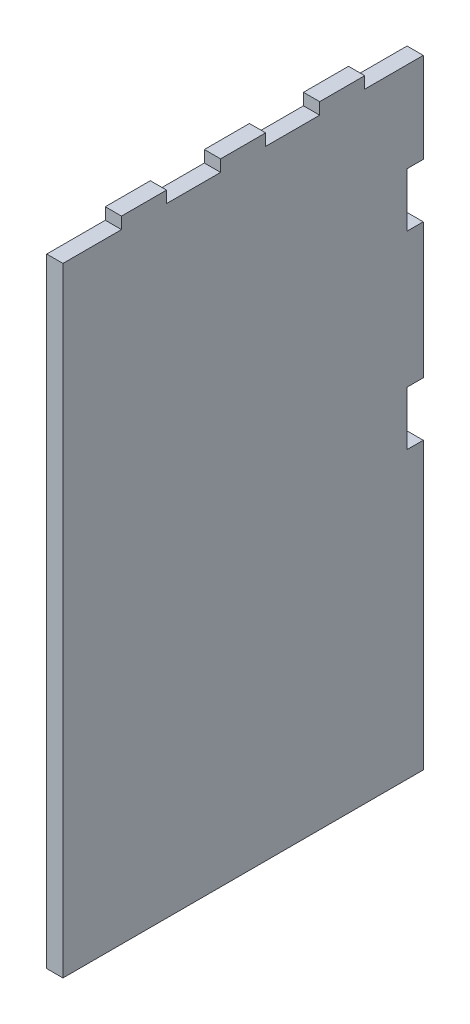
ISO-10303-21;
HEADER;
FILE_DESCRIPTION(('STEP AP214'),'2;1');
FILE_NAME('part.step','',(''),(''),'','','');
FILE_SCHEMA(('AUTOMOTIVE_DESIGN { 1 0 10303 214 1 1 1 1 }'));
ENDSEC;
DATA;
#1=APPLICATION_CONTEXT('core data for automotive mechanical design processes');
#2=APPLICATION_PROTOCOL_DEFINITION('international standard','automotive_design',2000,#1);
#3=PRODUCT_CONTEXT('',#1,'mechanical');
#4=PRODUCT('Part','Part','',(#3));
#5=PRODUCT_RELATED_PRODUCT_CATEGORY('part','',(#4));
#6=PRODUCT_DEFINITION_FORMATION('','',#4);
#7=PRODUCT_DEFINITION_CONTEXT('part definition',#1,'design');
#8=PRODUCT_DEFINITION('design','',#6,#7);
#9=PRODUCT_DEFINITION_SHAPE('','',#8);
#10=(LENGTH_UNIT() NAMED_UNIT(*) SI_UNIT(.MILLI.,.METRE.));
#11=(NAMED_UNIT(*) PLANE_ANGLE_UNIT() SI_UNIT($,.RADIAN.));
#12=(NAMED_UNIT(*) SI_UNIT($,.STERADIAN.) SOLID_ANGLE_UNIT());
#13=UNCERTAINTY_MEASURE_WITH_UNIT(LENGTH_MEASURE(1.E-05),#10,'distance_accuracy_value','');
#14=(GEOMETRIC_REPRESENTATION_CONTEXT(3) GLOBAL_UNCERTAINTY_ASSIGNED_CONTEXT((#13)) GLOBAL_UNIT_ASSIGNED_CONTEXT((#10,
#11,#12)) REPRESENTATION_CONTEXT('',''));
#15=CARTESIAN_POINT('',(0.,0.,0.));
#16=DIRECTION('',(0.,0.,1.));
#17=DIRECTION('',(1.,0.,0.));
#18=AXIS2_PLACEMENT_3D('',#15,#16,#17);
#19=CARTESIAN_POINT('',(18.,-350.,-200.));
#20=DIRECTION('',(0.,0.,1.));
#21=DIRECTION('',(1.,0.,0.));
#22=AXIS2_PLACEMENT_3D('',#19,#20,#21);
#23=PLANE('',#22);
#24=DIRECTION('',(-1.,0.,0.));
#25=VECTOR('',#24,1.);
#26=CARTESIAN_POINT('',(18.,27.,-200.));
#27=LINE('',#26,#25);
#28=CARTESIAN_POINT('',(18.,27.,-200.));
#29=VERTEX_POINT('',#28);
#30=CARTESIAN_POINT('',(0.,27.,-200.));
#31=VERTEX_POINT('',#30);
#32=EDGE_CURVE('E195',#29,#31,#27,.T.);
#33=ORIENTED_EDGE('',*,*,#32,.T.);
#34=DIRECTION('',(0.,1.,0.));
#35=VECTOR('',#34,1.);
#36=CARTESIAN_POINT('',(0.,-350.,-200.));
#37=LINE('',#36,#35);
#38=CARTESIAN_POINT('',(0.,177.,-200.));
#39=VERTEX_POINT('',#38);
#40=EDGE_CURVE('E56',#31,#39,#37,.T.);
#41=ORIENTED_EDGE('',*,*,#40,.T.);
#42=DIRECTION('',(-1.,0.,0.));
#43=VECTOR('',#42,1.);
#44=CARTESIAN_POINT('',(18.,177.,-200.));
#45=LINE('',#44,#43);
#46=CARTESIAN_POINT('',(18.,177.,-200.));
#47=VERTEX_POINT('',#46);
#48=EDGE_CURVE('E216',#47,#39,#45,.T.);
#49=ORIENTED_EDGE('',*,*,#48,.F.);
#50=DIRECTION('',(0.,1.,0.));
#51=VECTOR('',#50,1.);
#52=CARTESIAN_POINT('',(18.,-350.,-200.));
#53=LINE('',#52,#51);
#54=EDGE_CURVE('E210',#29,#47,#53,.T.);
#55=ORIENTED_EDGE('',*,*,#54,.F.);
#56=EDGE_LOOP('',(#33,#41,#49,#55));
#57=FACE_BOUND('',#56,.T.);
#58=ADVANCED_FACE('F33',(#57),#23,.F.);
#59=DIRECTION('',(-1.,0.,0.));
#60=VECTOR('',#59,1.);
#61=CARTESIAN_POINT('',(18.,-33.,-200.));
#62=LINE('',#61,#60);
#63=CARTESIAN_POINT('',(18.,-33.,-200.));
#64=VERTEX_POINT('',#63);
#65=CARTESIAN_POINT('',(0.,-33.,-200.));
#66=VERTEX_POINT('',#65);
#67=EDGE_CURVE('E48',#64,#66,#62,.T.);
#68=ORIENTED_EDGE('',*,*,#67,.F.);
#69=CARTESIAN_POINT('',(18.,-350.,-200.));
#70=VERTEX_POINT('',#69);
#71=EDGE_CURVE('E217',#70,#64,#53,.T.);
#72=ORIENTED_EDGE('',*,*,#71,.F.);
#73=DIRECTION('',(-1.,0.,0.));
#74=VECTOR('',#73,1.);
#75=CARTESIAN_POINT('',(18.,-350.,-200.));
#76=LINE('',#75,#74);
#77=CARTESIAN_POINT('',(0.,-350.,-200.));
#78=VERTEX_POINT('',#77);
#79=EDGE_CURVE('E41',#70,#78,#76,.T.);
#80=ORIENTED_EDGE('',*,*,#79,.T.);
#81=EDGE_CURVE('E235',#78,#66,#37,.T.);
#82=ORIENTED_EDGE('',*,*,#81,.T.);
#83=EDGE_LOOP('',(#68,#72,#80,#82));
#84=FACE_BOUND('',#83,.T.);
#85=ADVANCED_FACE('F410',(#84),#23,.F.);
#86=CARTESIAN_POINT('',(18.,0.,0.));
#87=DIRECTION('',(1.,0.,0.));
#88=DIRECTION('',(0.,0.,-1.));
#89=AXIS2_PLACEMENT_3D('',#86,#87,#88);
#90=PLANE('',#89);
#91=DIRECTION('',(0.,-1.,0.));
#92=VECTOR('',#91,1.);
#93=CARTESIAN_POINT('',(18.,27.,-182.));
#94=LINE('',#93,#92);
#95=CARTESIAN_POINT('',(18.,27.,-182.));
#96=VERTEX_POINT('',#95);
#97=CARTESIAN_POINT('',(18.,-33.,-182.));
#98=VERTEX_POINT('',#97);
#99=EDGE_CURVE('E213',#96,#98,#94,.T.);
#100=ORIENTED_EDGE('',*,*,#99,.F.);
#101=DIRECTION('',(0.,0.,1.));
#102=VECTOR('',#101,1.);
#103=CARTESIAN_POINT('',(18.,27.,-200.));
#104=LINE('',#103,#102);
#105=EDGE_CURVE('E198',#29,#96,#104,.T.);
#106=ORIENTED_EDGE('',*,*,#105,.F.);
#107=ORIENTED_EDGE('',*,*,#54,.T.);
#108=DIRECTION('',(0.,0.,-1.));
#109=VECTOR('',#108,1.);
#110=CARTESIAN_POINT('',(18.,177.,-200.));
#111=LINE('',#110,#109);
#112=CARTESIAN_POINT('',(18.,177.,-182.));
#113=VERTEX_POINT('',#112);
#114=EDGE_CURVE('E380',#113,#47,#111,.T.);
#115=ORIENTED_EDGE('',*,*,#114,.F.);
#116=DIRECTION('',(0.,-1.,0.));
#117=VECTOR('',#116,1.);
#118=CARTESIAN_POINT('',(18.,237.,-182.));
#119=LINE('',#118,#117);
#120=CARTESIAN_POINT('',(18.,237.,-182.));
#121=VERTEX_POINT('',#120);
#122=EDGE_CURVE('E391',#121,#113,#119,.T.);
#123=ORIENTED_EDGE('',*,*,#122,.F.);
#124=DIRECTION('',(0.,0.,1.));
#125=VECTOR('',#124,1.);
#126=CARTESIAN_POINT('',(18.,237.,-200.));
#127=LINE('',#126,#125);
#128=CARTESIAN_POINT('',(18.,237.,-200.));
#129=VERTEX_POINT('',#128);
#130=EDGE_CURVE('E384',#129,#121,#127,.T.);
#131=ORIENTED_EDGE('',*,*,#130,.F.);
#132=CARTESIAN_POINT('',(18.,337.,-200.));
#133=VERTEX_POINT('',#132);
#134=EDGE_CURVE('E218',#129,#133,#53,.T.);
#135=ORIENTED_EDGE('',*,*,#134,.T.);
#136=DIRECTION('',(0.,0.,-1.));
#137=VECTOR('',#136,1.);
#138=CARTESIAN_POINT('',(18.,337.,0.));
#139=LINE('',#138,#137);
#140=CARTESIAN_POINT('',(18.,337.,-135.));
#141=VERTEX_POINT('',#140);
#142=EDGE_CURVE('E307',#141,#133,#139,.T.);
#143=ORIENTED_EDGE('',*,*,#142,.F.);
#144=DIRECTION('',(0.,-1.,0.));
#145=VECTOR('',#144,1.);
#146=CARTESIAN_POINT('',(18.,-2.88230977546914E-13,-134.999999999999));
#147=LINE('',#146,#145);
#148=CARTESIAN_POINT('',(18.,350.,-135.));
#149=VERTEX_POINT('',#148);
#150=EDGE_CURVE('E310',#149,#141,#147,.T.);
#151=ORIENTED_EDGE('',*,*,#150,.F.);
#152=DIRECTION('',(0.,0.,1.));
#153=VECTOR('',#152,1.);
#154=CARTESIAN_POINT('',(18.,350.,-200.));
#155=LINE('',#154,#153);
#156=CARTESIAN_POINT('',(18.,350.,-85.));
#157=VERTEX_POINT('',#156);
#158=EDGE_CURVE('E228',#149,#157,#155,.T.);
#159=ORIENTED_EDGE('',*,*,#158,.T.);
#160=DIRECTION('',(0.,-1.,0.));
#161=VECTOR('',#160,1.);
#162=CARTESIAN_POINT('',(18.,-5.44436290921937E-13,-84.9999999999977));
#163=LINE('',#162,#161);
#164=CARTESIAN_POINT('',(18.,337.,-84.9999999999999));
#165=VERTEX_POINT('',#164);
#166=EDGE_CURVE('E288',#157,#165,#163,.T.);
#167=ORIENTED_EDGE('',*,*,#166,.T.);
#168=DIRECTION('',(0.,0.,-1.));
#169=VECTOR('',#168,1.);
#170=CARTESIAN_POINT('',(18.,337.,0.));
#171=LINE('',#170,#169);
#172=CARTESIAN_POINT('',(18.,337.,-24.9999999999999));
#173=VERTEX_POINT('',#172);
#174=EDGE_CURVE('E285',#173,#165,#171,.T.);
#175=ORIENTED_EDGE('',*,*,#174,.F.);
#176=DIRECTION('',(0.,-1.,0.));
#177=VECTOR('',#176,1.);
#178=CARTESIAN_POINT('',(18.,-1.06752213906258E-13,-24.9999999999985));
#179=LINE('',#178,#177);
#180=CARTESIAN_POINT('',(18.,350.,-25.));
#181=VERTEX_POINT('',#180);
#182=EDGE_CURVE('E257',#181,#173,#179,.T.);
#183=ORIENTED_EDGE('',*,*,#182,.F.);
#184=CARTESIAN_POINT('',(18.,350.,25.));
#185=VERTEX_POINT('',#184);
#186=EDGE_CURVE('E227',#181,#185,#155,.T.);
#187=ORIENTED_EDGE('',*,*,#186,.T.);
#188=DIRECTION('',(0.,-1.,0.));
#189=VECTOR('',#188,1.);
#190=CARTESIAN_POINT('',(18.,0.,25.0000000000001));
#191=LINE('',#190,#189);
#192=CARTESIAN_POINT('',(18.,337.,25.0000000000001));
#193=VERTEX_POINT('',#192);
#194=EDGE_CURVE('E255',#185,#193,#191,.T.);
#195=ORIENTED_EDGE('',*,*,#194,.T.);
#196=DIRECTION('',(0.,0.,-1.));
#197=VECTOR('',#196,1.);
#198=CARTESIAN_POINT('',(18.,337.,0.));
#199=LINE('',#198,#197);
#200=CARTESIAN_POINT('',(18.,337.,85.0000000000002));
#201=VERTEX_POINT('',#200);
#202=EDGE_CURVE('E273',#201,#193,#199,.T.);
#203=ORIENTED_EDGE('',*,*,#202,.F.);
#204=DIRECTION('',(0.,-1.,0.));
#205=VECTOR('',#204,1.);
#206=CARTESIAN_POINT('',(18.,0.,85.0000000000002));
#207=LINE('',#206,#205);
#208=CARTESIAN_POINT('',(18.,350.,85.0000000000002));
#209=VERTEX_POINT('',#208);
#210=EDGE_CURVE('E368',#209,#201,#207,.T.);
#211=ORIENTED_EDGE('',*,*,#210,.F.);
#212=CARTESIAN_POINT('',(18.,350.,135.));
#213=VERTEX_POINT('',#212);
#214=EDGE_CURVE('E221',#209,#213,#155,.T.);
#215=ORIENTED_EDGE('',*,*,#214,.T.);
#216=DIRECTION('',(0.,-1.,0.));
#217=VECTOR('',#216,1.);
#218=CARTESIAN_POINT('',(18.,0.,135.));
#219=LINE('',#218,#217);
#220=CARTESIAN_POINT('',(18.,337.,135.));
#221=VERTEX_POINT('',#220);
#222=EDGE_CURVE('E330',#213,#221,#219,.T.);
#223=ORIENTED_EDGE('',*,*,#222,.T.);
#224=DIRECTION('',(0.,0.,1.));
#225=VECTOR('',#224,1.);
#226=CARTESIAN_POINT('',(18.,337.,0.));
#227=LINE('',#226,#225);
#228=CARTESIAN_POINT('',(18.,337.,200.));
#229=VERTEX_POINT('',#228);
#230=EDGE_CURVE('E327',#221,#229,#227,.T.);
#231=ORIENTED_EDGE('',*,*,#230,.T.);
#232=DIRECTION('',(0.,-1.,0.));
#233=VECTOR('',#232,1.);
#234=CARTESIAN_POINT('',(18.,-350.,200.));
#235=LINE('',#234,#233);
#236=CARTESIAN_POINT('',(18.,-350.,200.));
#237=VERTEX_POINT('',#236);
#238=EDGE_CURVE('E343',#229,#237,#235,.T.);
#239=ORIENTED_EDGE('',*,*,#238,.T.);
#240=DIRECTION('',(0.,0.,-1.));
#241=VECTOR('',#240,1.);
#242=CARTESIAN_POINT('',(18.,-350.,-200.));
#243=LINE('',#242,#241);
#244=EDGE_CURVE('E222',#237,#70,#243,.T.);
#245=ORIENTED_EDGE('',*,*,#244,.T.);
#246=ORIENTED_EDGE('',*,*,#71,.T.);
#247=DIRECTION('',(0.,0.,-1.));
#248=VECTOR('',#247,1.);
#249=CARTESIAN_POINT('',(18.,-33.,-200.));
#250=LINE('',#249,#248);
#251=EDGE_CURVE('E398',#98,#64,#250,.T.);
#252=ORIENTED_EDGE('',*,*,#251,.F.);
#253=EDGE_LOOP('',(#100,#106,#107,#115,#123,#131,#135,#143,#151,#159,#167,#175,#183,#187,#195,
#203,#211,#215,#223,#231,#239,#245,#246,#252));
#254=FACE_BOUND('',#253,.T.);
#255=ADVANCED_FACE('F208',(#254),#90,.T.);
#256=CARTESIAN_POINT('',(0.,0.,0.));
#257=DIRECTION('',(1.,0.,0.));
#258=DIRECTION('',(0.,0.,-1.));
#259=AXIS2_PLACEMENT_3D('',#256,#257,#258);
#260=PLANE('',#259);
#261=DIRECTION('',(0.,0.,1.));
#262=VECTOR('',#261,1.);
#263=CARTESIAN_POINT('',(0.,27.,-200.));
#264=LINE('',#263,#262);
#265=CARTESIAN_POINT('',(0.,27.,-182.));
#266=VERTEX_POINT('',#265);
#267=EDGE_CURVE('E201',#31,#266,#264,.T.);
#268=ORIENTED_EDGE('',*,*,#267,.T.);
#269=DIRECTION('',(0.,-1.,0.));
#270=VECTOR('',#269,1.);
#271=CARTESIAN_POINT('',(0.,27.,-182.));
#272=LINE('',#271,#270);
#273=CARTESIAN_POINT('',(0.,-33.,-182.));
#274=VERTEX_POINT('',#273);
#275=EDGE_CURVE('E400',#266,#274,#272,.T.);
#276=ORIENTED_EDGE('',*,*,#275,.T.);
#277=DIRECTION('',(0.,0.,-1.));
#278=VECTOR('',#277,1.);
#279=CARTESIAN_POINT('',(0.,-33.,-200.));
#280=LINE('',#279,#278);
#281=EDGE_CURVE('E214',#274,#66,#280,.T.);
#282=ORIENTED_EDGE('',*,*,#281,.T.);
#283=ORIENTED_EDGE('',*,*,#81,.F.);
#284=DIRECTION('',(0.,0.,-1.));
#285=VECTOR('',#284,1.);
#286=CARTESIAN_POINT('',(0.,-350.,-200.));
#287=LINE('',#286,#285);
#288=CARTESIAN_POINT('',(0.,-350.,200.));
#289=VERTEX_POINT('',#288);
#290=EDGE_CURVE('E231',#289,#78,#287,.T.);
#291=ORIENTED_EDGE('',*,*,#290,.F.);
#292=DIRECTION('',(0.,-1.,0.));
#293=VECTOR('',#292,1.);
#294=CARTESIAN_POINT('',(0.,-350.,200.));
#295=LINE('',#294,#293);
#296=CARTESIAN_POINT('',(0.,337.,200.));
#297=VERTEX_POINT('',#296);
#298=EDGE_CURVE('E229',#297,#289,#295,.T.);
#299=ORIENTED_EDGE('',*,*,#298,.F.);
#300=DIRECTION('',(0.,0.,1.));
#301=VECTOR('',#300,1.);
#302=CARTESIAN_POINT('',(0.,337.,0.));
#303=LINE('',#302,#301);
#304=CARTESIAN_POINT('',(0.,337.,135.));
#305=VERTEX_POINT('',#304);
#306=EDGE_CURVE('E283',#305,#297,#303,.T.);
#307=ORIENTED_EDGE('',*,*,#306,.F.);
#308=DIRECTION('',(0.,-1.,0.));
#309=VECTOR('',#308,1.);
#310=CARTESIAN_POINT('',(0.,0.,135.));
#311=LINE('',#310,#309);
#312=CARTESIAN_POINT('',(0.,350.,135.));
#313=VERTEX_POINT('',#312);
#314=EDGE_CURVE('E331',#313,#305,#311,.T.);
#315=ORIENTED_EDGE('',*,*,#314,.F.);
#316=DIRECTION('',(0.,0.,1.));
#317=VECTOR('',#316,1.);
#318=CARTESIAN_POINT('',(0.,350.,-200.));
#319=LINE('',#318,#317);
#320=CARTESIAN_POINT('',(0.,350.,85.0000000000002));
#321=VERTEX_POINT('',#320);
#322=EDGE_CURVE('E238',#321,#313,#319,.T.);
#323=ORIENTED_EDGE('',*,*,#322,.F.);
#324=DIRECTION('',(0.,-1.,0.));
#325=VECTOR('',#324,1.);
#326=CARTESIAN_POINT('',(0.,0.,85.0000000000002));
#327=LINE('',#326,#325);
#328=CARTESIAN_POINT('',(0.,337.,85.0000000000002));
#329=VERTEX_POINT('',#328);
#330=EDGE_CURVE('E306',#321,#329,#327,.T.);
#331=ORIENTED_EDGE('',*,*,#330,.T.);
#332=DIRECTION('',(0.,0.,-1.));
#333=VECTOR('',#332,1.);
#334=CARTESIAN_POINT('',(0.,337.,0.));
#335=LINE('',#334,#333);
#336=CARTESIAN_POINT('',(0.,337.,25.0000000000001));
#337=VERTEX_POINT('',#336);
#338=EDGE_CURVE('E366',#329,#337,#335,.T.);
#339=ORIENTED_EDGE('',*,*,#338,.T.);
#340=DIRECTION('',(0.,-1.,0.));
#341=VECTOR('',#340,1.);
#342=CARTESIAN_POINT('',(0.,0.,25.0000000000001));
#343=LINE('',#342,#341);
#344=CARTESIAN_POINT('',(0.,350.,25.));
#345=VERTEX_POINT('',#344);
#346=EDGE_CURVE('E276',#345,#337,#343,.T.);
#347=ORIENTED_EDGE('',*,*,#346,.F.);
#348=CARTESIAN_POINT('',(0.,350.,-25.));
#349=VERTEX_POINT('',#348);
#350=EDGE_CURVE('E239',#349,#345,#319,.T.);
#351=ORIENTED_EDGE('',*,*,#350,.F.);
#352=DIRECTION('',(0.,-1.,0.));
#353=VECTOR('',#352,1.);
#354=CARTESIAN_POINT('',(0.,-1.06752213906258E-13,-24.9999999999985));
#355=LINE('',#354,#353);
#356=CARTESIAN_POINT('',(0.,337.,-24.9999999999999));
#357=VERTEX_POINT('',#356);
#358=EDGE_CURVE('E291',#349,#357,#355,.T.);
#359=ORIENTED_EDGE('',*,*,#358,.T.);
#360=DIRECTION('',(0.,0.,-1.));
#361=VECTOR('',#360,1.);
#362=CARTESIAN_POINT('',(0.,337.,0.));
#363=LINE('',#362,#361);
#364=CARTESIAN_POINT('',(0.,337.,-84.9999999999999));
#365=VERTEX_POINT('',#364);
#366=EDGE_CURVE('E294',#357,#365,#363,.T.);
#367=ORIENTED_EDGE('',*,*,#366,.T.);
#368=DIRECTION('',(0.,-1.,0.));
#369=VECTOR('',#368,1.);
#370=CARTESIAN_POINT('',(0.,-5.44436290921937E-13,-84.9999999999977));
#371=LINE('',#370,#369);
#372=CARTESIAN_POINT('',(0.,350.,-84.9999999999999));
#373=VERTEX_POINT('',#372);
#374=EDGE_CURVE('E286',#373,#365,#371,.T.);
#375=ORIENTED_EDGE('',*,*,#374,.F.);
#376=CARTESIAN_POINT('',(0.,350.,-135.));
#377=VERTEX_POINT('',#376);
#378=EDGE_CURVE('E240',#377,#373,#319,.T.);
#379=ORIENTED_EDGE('',*,*,#378,.F.);
#380=DIRECTION('',(0.,-1.,0.));
#381=VECTOR('',#380,1.);
#382=CARTESIAN_POINT('',(0.,-2.88230977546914E-13,-134.999999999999));
#383=LINE('',#382,#381);
#384=CARTESIAN_POINT('',(0.,337.,-135.));
#385=VERTEX_POINT('',#384);
#386=EDGE_CURVE('E311',#377,#385,#383,.T.);
#387=ORIENTED_EDGE('',*,*,#386,.T.);
#388=DIRECTION('',(0.,0.,-1.));
#389=VECTOR('',#388,1.);
#390=CARTESIAN_POINT('',(0.,337.,0.));
#391=LINE('',#390,#389);
#392=CARTESIAN_POINT('',(0.,337.,-200.));
#393=VERTEX_POINT('',#392);
#394=EDGE_CURVE('E314',#385,#393,#391,.T.);
#395=ORIENTED_EDGE('',*,*,#394,.T.);
#396=CARTESIAN_POINT('',(0.,237.,-200.));
#397=VERTEX_POINT('',#396);
#398=EDGE_CURVE('E234',#397,#393,#37,.T.);
#399=ORIENTED_EDGE('',*,*,#398,.F.);
#400=DIRECTION('',(0.,0.,1.));
#401=VECTOR('',#400,1.);
#402=CARTESIAN_POINT('',(0.,237.,-200.));
#403=LINE('',#402,#401);
#404=CARTESIAN_POINT('',(0.,237.,-182.));
#405=VERTEX_POINT('',#404);
#406=EDGE_CURVE('E203',#397,#405,#403,.T.);
#407=ORIENTED_EDGE('',*,*,#406,.T.);
#408=DIRECTION('',(0.,-1.,0.));
#409=VECTOR('',#408,1.);
#410=CARTESIAN_POINT('',(0.,237.,-182.));
#411=LINE('',#410,#409);
#412=CARTESIAN_POINT('',(0.,177.,-182.));
#413=VERTEX_POINT('',#412);
#414=EDGE_CURVE('E385',#405,#413,#411,.T.);
#415=ORIENTED_EDGE('',*,*,#414,.T.);
#416=DIRECTION('',(0.,0.,-1.));
#417=VECTOR('',#416,1.);
#418=CARTESIAN_POINT('',(0.,177.,-200.));
#419=LINE('',#418,#417);
#420=EDGE_CURVE('E381',#413,#39,#419,.T.);
#421=ORIENTED_EDGE('',*,*,#420,.T.);
#422=ORIENTED_EDGE('',*,*,#40,.F.);
#423=EDGE_LOOP('',(#268,#276,#282,#283,#291,#299,#307,#315,#323,#331,#339,#347,#351,#359,#367,
#375,#379,#387,#395,#399,#407,#415,#421,#422));
#424=FACE_BOUND('',#423,.T.);
#425=ADVANCED_FACE('F353',(#424),#260,.F.);
#426=DIRECTION('',(-1.,0.,0.));
#427=VECTOR('',#426,1.);
#428=CARTESIAN_POINT('',(18.,237.,-200.));
#429=LINE('',#428,#427);
#430=EDGE_CURVE('E317',#129,#397,#429,.T.);
#431=ORIENTED_EDGE('',*,*,#430,.T.);
#432=ORIENTED_EDGE('',*,*,#398,.T.);
#433=DIRECTION('',(-1.,0.,0.));
#434=VECTOR('',#433,1.);
#435=CARTESIAN_POINT('',(18.,337.,-200.));
#436=LINE('',#435,#434);
#437=EDGE_CURVE('E295',#133,#393,#436,.T.);
#438=ORIENTED_EDGE('',*,*,#437,.F.);
#439=ORIENTED_EDGE('',*,*,#134,.F.);
#440=EDGE_LOOP('',(#431,#432,#438,#439));
#441=FACE_BOUND('',#440,.T.);
#442=ADVANCED_FACE('F417',(#441),#23,.F.);
#443=CARTESIAN_POINT('',(18.,350.,-200.));
#444=DIRECTION('',(0.,-1.,0.));
#445=DIRECTION('',(0.,0.,-1.));
#446=AXIS2_PLACEMENT_3D('',#443,#444,#445);
#447=PLANE('',#446);
#448=DIRECTION('',(-1.,0.,0.));
#449=VECTOR('',#448,1.);
#450=CARTESIAN_POINT('',(18.,350.,85.0000000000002));
#451=LINE('',#450,#449);
#452=EDGE_CURVE('E280',#209,#321,#451,.T.);
#453=ORIENTED_EDGE('',*,*,#452,.T.);
#454=ORIENTED_EDGE('',*,*,#322,.T.);
#455=DIRECTION('',(-1.,0.,0.));
#456=VECTOR('',#455,1.);
#457=CARTESIAN_POINT('',(18.,350.,135.));
#458=LINE('',#457,#456);
#459=EDGE_CURVE('E334',#213,#313,#458,.T.);
#460=ORIENTED_EDGE('',*,*,#459,.F.);
#461=ORIENTED_EDGE('',*,*,#214,.F.);
#462=EDGE_LOOP('',(#453,#454,#460,#461));
#463=FACE_BOUND('',#462,.T.);
#464=ADVANCED_FACE('F449',(#463),#447,.F.);
#465=ORIENTED_EDGE('',*,*,#350,.T.);
#466=DIRECTION('',(-1.,0.,0.));
#467=VECTOR('',#466,1.);
#468=CARTESIAN_POINT('',(18.,350.,25.));
#469=LINE('',#468,#467);
#470=EDGE_CURVE('E265',#185,#345,#469,.T.);
#471=ORIENTED_EDGE('',*,*,#470,.F.);
#472=ORIENTED_EDGE('',*,*,#186,.F.);
#473=DIRECTION('',(-1.,0.,0.));
#474=VECTOR('',#473,1.);
#475=CARTESIAN_POINT('',(18.,350.,-25.));
#476=LINE('',#475,#474);
#477=EDGE_CURVE('E263',#181,#349,#476,.T.);
#478=ORIENTED_EDGE('',*,*,#477,.T.);
#479=EDGE_LOOP('',(#465,#471,#472,#478));
#480=FACE_BOUND('',#479,.T.);
#481=ADVANCED_FACE('F262',(#480),#447,.F.);
#482=ORIENTED_EDGE('',*,*,#378,.T.);
#483=DIRECTION('',(-1.,0.,0.));
#484=VECTOR('',#483,1.);
#485=CARTESIAN_POINT('',(18.,350.,-85.));
#486=LINE('',#485,#484);
#487=EDGE_CURVE('E290',#157,#373,#486,.T.);
#488=ORIENTED_EDGE('',*,*,#487,.F.);
#489=ORIENTED_EDGE('',*,*,#158,.F.);
#490=DIRECTION('',(-1.,0.,0.));
#491=VECTOR('',#490,1.);
#492=CARTESIAN_POINT('',(18.,350.,-135.));
#493=LINE('',#492,#491);
#494=EDGE_CURVE('E322',#149,#377,#493,.T.);
#495=ORIENTED_EDGE('',*,*,#494,.T.);
#496=EDGE_LOOP('',(#482,#488,#489,#495));
#497=FACE_BOUND('',#496,.T.);
#498=ADVANCED_FACE('F350',(#497),#447,.F.);
#499=CARTESIAN_POINT('',(18.,-350.,200.));
#500=DIRECTION('',(0.,0.,-1.));
#501=DIRECTION('',(-1.,0.,0.));
#502=AXIS2_PLACEMENT_3D('',#499,#500,#501);
#503=PLANE('',#502);
#504=ORIENTED_EDGE('',*,*,#238,.F.);
#505=DIRECTION('',(-1.,0.,0.));
#506=VECTOR('',#505,1.);
#507=CARTESIAN_POINT('',(18.,337.,200.));
#508=LINE('',#507,#506);
#509=EDGE_CURVE('E232',#229,#297,#508,.T.);
#510=ORIENTED_EDGE('',*,*,#509,.T.);
#511=ORIENTED_EDGE('',*,*,#298,.T.);
#512=DIRECTION('',(-1.,0.,0.));
#513=VECTOR('',#512,1.);
#514=CARTESIAN_POINT('',(18.,-350.,200.));
#515=LINE('',#514,#513);
#516=EDGE_CURVE('E11',#237,#289,#515,.T.);
#517=ORIENTED_EDGE('',*,*,#516,.F.);
#518=EDGE_LOOP('',(#504,#510,#511,#517));
#519=FACE_BOUND('',#518,.T.);
#520=ADVANCED_FACE('F35',(#519),#503,.F.);
#521=CARTESIAN_POINT('',(18.,-350.,-200.));
#522=DIRECTION('',(0.,1.,0.));
#523=DIRECTION('',(0.,0.,1.));
#524=AXIS2_PLACEMENT_3D('',#521,#522,#523);
#525=PLANE('',#524);
#526=ORIENTED_EDGE('',*,*,#290,.T.);
#527=ORIENTED_EDGE('',*,*,#79,.F.);
#528=ORIENTED_EDGE('',*,*,#244,.F.);
#529=ORIENTED_EDGE('',*,*,#516,.T.);
#530=EDGE_LOOP('',(#526,#527,#528,#529));
#531=FACE_BOUND('',#530,.T.);
#532=ADVANCED_FACE('F465',(#531),#525,.F.);
#533=CARTESIAN_POINT('',(18.,337.,0.));
#534=DIRECTION('',(0.,-1.,0.));
#535=DIRECTION('',(0.,0.,-1.));
#536=AXIS2_PLACEMENT_3D('',#533,#534,#535);
#537=PLANE('',#536);
#538=ORIENTED_EDGE('',*,*,#306,.T.);
#539=ORIENTED_EDGE('',*,*,#509,.F.);
#540=ORIENTED_EDGE('',*,*,#230,.F.);
#541=DIRECTION('',(-1.,0.,0.));
#542=VECTOR('',#541,1.);
#543=CARTESIAN_POINT('',(18.,337.,135.));
#544=LINE('',#543,#542);
#545=EDGE_CURVE('E340',#221,#305,#544,.T.);
#546=ORIENTED_EDGE('',*,*,#545,.T.);
#547=EDGE_LOOP('',(#538,#539,#540,#546));
#548=FACE_BOUND('',#547,.T.);
#549=ADVANCED_FACE('F461',(#548),#537,.F.);
#550=CARTESIAN_POINT('',(18.,0.,135.));
#551=DIRECTION('',(0.,0.,-1.));
#552=DIRECTION('',(-1.,0.,0.));
#553=AXIS2_PLACEMENT_3D('',#550,#551,#552);
#554=PLANE('',#553);
#555=ORIENTED_EDGE('',*,*,#314,.T.);
#556=ORIENTED_EDGE('',*,*,#545,.F.);
#557=ORIENTED_EDGE('',*,*,#222,.F.);
#558=ORIENTED_EDGE('',*,*,#459,.T.);
#559=EDGE_LOOP('',(#555,#556,#557,#558));
#560=FACE_BOUND('',#559,.T.);
#561=ADVANCED_FACE('F464',(#560),#554,.F.);
#562=CARTESIAN_POINT('',(18.,337.,0.));
#563=DIRECTION('',(0.,1.,0.));
#564=DIRECTION('',(0.,0.,1.));
#565=AXIS2_PLACEMENT_3D('',#562,#563,#564);
#566=PLANE('',#565);
#567=ORIENTED_EDGE('',*,*,#394,.F.);
#568=DIRECTION('',(-1.,0.,0.));
#569=VECTOR('',#568,1.);
#570=CARTESIAN_POINT('',(18.,337.,-135.));
#571=LINE('',#570,#569);
#572=EDGE_CURVE('E313',#141,#385,#571,.T.);
#573=ORIENTED_EDGE('',*,*,#572,.F.);
#574=ORIENTED_EDGE('',*,*,#142,.T.);
#575=ORIENTED_EDGE('',*,*,#437,.T.);
#576=EDGE_LOOP('',(#567,#573,#574,#575));
#577=FACE_BOUND('',#576,.T.);
#578=ADVANCED_FACE('F420',(#577),#566,.T.);
#579=CARTESIAN_POINT('',(18.,-2.88230977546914E-13,-134.999999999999));
#580=DIRECTION('',(0.,0.,-1.));
#581=DIRECTION('',(0.,1.,0.));
#582=AXIS2_PLACEMENT_3D('',#579,#580,#581);
#583=PLANE('',#582);
#584=ORIENTED_EDGE('',*,*,#386,.F.);
#585=ORIENTED_EDGE('',*,*,#494,.F.);
#586=ORIENTED_EDGE('',*,*,#150,.T.);
#587=ORIENTED_EDGE('',*,*,#572,.T.);
#588=EDGE_LOOP('',(#584,#585,#586,#587));
#589=FACE_BOUND('',#588,.T.);
#590=ADVANCED_FACE('F472',(#589),#583,.T.);
#591=CARTESIAN_POINT('',(18.,-1.06752213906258E-13,-24.9999999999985));
#592=DIRECTION('',(0.,0.,-1.));
#593=DIRECTION('',(0.,1.,0.));
#594=AXIS2_PLACEMENT_3D('',#591,#592,#593);
#595=PLANE('',#594);
#596=ORIENTED_EDGE('',*,*,#358,.F.);
#597=ORIENTED_EDGE('',*,*,#477,.F.);
#598=ORIENTED_EDGE('',*,*,#182,.T.);
#599=DIRECTION('',(-1.,0.,0.));
#600=VECTOR('',#599,1.);
#601=CARTESIAN_POINT('',(18.,337.,-24.9999999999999));
#602=LINE('',#601,#600);
#603=EDGE_CURVE('E303',#173,#357,#602,.T.);
#604=ORIENTED_EDGE('',*,*,#603,.T.);
#605=EDGE_LOOP('',(#596,#597,#598,#604));
#606=FACE_BOUND('',#605,.T.);
#607=ADVANCED_FACE('F362',(#606),#595,.T.);
#608=CARTESIAN_POINT('',(18.,337.,0.));
#609=DIRECTION('',(0.,1.,0.));
#610=DIRECTION('',(0.,0.,1.));
#611=AXIS2_PLACEMENT_3D('',#608,#609,#610);
#612=PLANE('',#611);
#613=ORIENTED_EDGE('',*,*,#366,.F.);
#614=ORIENTED_EDGE('',*,*,#603,.F.);
#615=ORIENTED_EDGE('',*,*,#174,.T.);
#616=DIRECTION('',(-1.,0.,0.));
#617=VECTOR('',#616,1.);
#618=CARTESIAN_POINT('',(18.,337.,-84.9999999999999));
#619=LINE('',#618,#617);
#620=EDGE_CURVE('E301',#165,#365,#619,.T.);
#621=ORIENTED_EDGE('',*,*,#620,.T.);
#622=EDGE_LOOP('',(#613,#614,#615,#621));
#623=FACE_BOUND('',#622,.T.);
#624=ADVANCED_FACE('F360',(#623),#612,.T.);
#625=CARTESIAN_POINT('',(18.,-5.44436290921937E-13,-84.9999999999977));
#626=DIRECTION('',(0.,0.,-1.));
#627=DIRECTION('',(0.,1.,0.));
#628=AXIS2_PLACEMENT_3D('',#625,#626,#627);
#629=PLANE('',#628);
#630=ORIENTED_EDGE('',*,*,#374,.T.);
#631=ORIENTED_EDGE('',*,*,#620,.F.);
#632=ORIENTED_EDGE('',*,*,#166,.F.);
#633=ORIENTED_EDGE('',*,*,#487,.T.);
#634=EDGE_LOOP('',(#630,#631,#632,#633));
#635=FACE_BOUND('',#634,.T.);
#636=ADVANCED_FACE('F357',(#635),#629,.F.);
#637=CARTESIAN_POINT('',(18.,0.,85.0000000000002));
#638=DIRECTION('',(0.,0.,-1.));
#639=DIRECTION('',(-1.,0.,0.));
#640=AXIS2_PLACEMENT_3D('',#637,#638,#639);
#641=PLANE('',#640);
#642=ORIENTED_EDGE('',*,*,#330,.F.);
#643=ORIENTED_EDGE('',*,*,#452,.F.);
#644=ORIENTED_EDGE('',*,*,#210,.T.);
#645=DIRECTION('',(-1.,0.,0.));
#646=VECTOR('',#645,1.);
#647=CARTESIAN_POINT('',(18.,337.,85.0000000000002));
#648=LINE('',#647,#646);
#649=EDGE_CURVE('E271',#201,#329,#648,.T.);
#650=ORIENTED_EDGE('',*,*,#649,.T.);
#651=EDGE_LOOP('',(#642,#643,#644,#650));
#652=FACE_BOUND('',#651,.T.);
#653=ADVANCED_FACE('F482',(#652),#641,.T.);
#654=CARTESIAN_POINT('',(18.,337.,0.));
#655=DIRECTION('',(0.,1.,0.));
#656=DIRECTION('',(0.,0.,1.));
#657=AXIS2_PLACEMENT_3D('',#654,#655,#656);
#658=PLANE('',#657);
#659=ORIENTED_EDGE('',*,*,#338,.F.);
#660=ORIENTED_EDGE('',*,*,#649,.F.);
#661=ORIENTED_EDGE('',*,*,#202,.T.);
#662=DIRECTION('',(-1.,0.,0.));
#663=VECTOR('',#662,1.);
#664=CARTESIAN_POINT('',(18.,337.,25.0000000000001));
#665=LINE('',#664,#663);
#666=EDGE_CURVE('E269',#193,#337,#665,.T.);
#667=ORIENTED_EDGE('',*,*,#666,.T.);
#668=EDGE_LOOP('',(#659,#660,#661,#667));
#669=FACE_BOUND('',#668,.T.);
#670=ADVANCED_FACE('F485',(#669),#658,.T.);
#671=CARTESIAN_POINT('',(18.,0.,25.0000000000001));
#672=DIRECTION('',(0.,0.,-1.));
#673=DIRECTION('',(0.,1.,0.));
#674=AXIS2_PLACEMENT_3D('',#671,#672,#673);
#675=PLANE('',#674);
#676=ORIENTED_EDGE('',*,*,#346,.T.);
#677=ORIENTED_EDGE('',*,*,#666,.F.);
#678=ORIENTED_EDGE('',*,*,#194,.F.);
#679=ORIENTED_EDGE('',*,*,#470,.T.);
#680=EDGE_LOOP('',(#676,#677,#678,#679));
#681=FACE_BOUND('',#680,.T.);
#682=ADVANCED_FACE('F489',(#681),#675,.F.);
#683=CARTESIAN_POINT('',(18.,237.,-200.));
#684=DIRECTION('',(0.,-1.,0.));
#685=DIRECTION('',(0.,0.,-1.));
#686=AXIS2_PLACEMENT_3D('',#683,#684,#685);
#687=PLANE('',#686);
#688=ORIENTED_EDGE('',*,*,#406,.F.);
#689=ORIENTED_EDGE('',*,*,#430,.F.);
#690=ORIENTED_EDGE('',*,*,#130,.T.);
#691=DIRECTION('',(-1.,0.,0.));
#692=VECTOR('',#691,1.);
#693=CARTESIAN_POINT('',(18.,237.,-182.));
#694=LINE('',#693,#692);
#695=EDGE_CURVE('E375',#121,#405,#694,.T.);
#696=ORIENTED_EDGE('',*,*,#695,.T.);
#697=EDGE_LOOP('',(#688,#689,#690,#696));
#698=FACE_BOUND('',#697,.T.);
#699=ADVANCED_FACE('F427',(#698),#687,.T.);
#700=CARTESIAN_POINT('',(18.,237.,-182.));
#701=DIRECTION('',(0.,0.,-1.));
#702=DIRECTION('',(0.,1.,0.));
#703=AXIS2_PLACEMENT_3D('',#700,#701,#702);
#704=PLANE('',#703);
#705=ORIENTED_EDGE('',*,*,#414,.F.);
#706=ORIENTED_EDGE('',*,*,#695,.F.);
#707=ORIENTED_EDGE('',*,*,#122,.T.);
#708=DIRECTION('',(-1.,0.,0.));
#709=VECTOR('',#708,1.);
#710=CARTESIAN_POINT('',(18.,177.,-182.));
#711=LINE('',#710,#709);
#712=EDGE_CURVE('E377',#113,#413,#711,.T.);
#713=ORIENTED_EDGE('',*,*,#712,.T.);
#714=EDGE_LOOP('',(#705,#706,#707,#713));
#715=FACE_BOUND('',#714,.T.);
#716=ADVANCED_FACE('F430',(#715),#704,.T.);
#717=CARTESIAN_POINT('',(18.,177.,-200.));
#718=DIRECTION('',(0.,1.,0.));
#719=DIRECTION('',(0.,0.,1.));
#720=AXIS2_PLACEMENT_3D('',#717,#718,#719);
#721=PLANE('',#720);
#722=ORIENTED_EDGE('',*,*,#420,.F.);
#723=ORIENTED_EDGE('',*,*,#712,.F.);
#724=ORIENTED_EDGE('',*,*,#114,.T.);
#725=ORIENTED_EDGE('',*,*,#48,.T.);
#726=EDGE_LOOP('',(#722,#723,#724,#725));
#727=FACE_BOUND('',#726,.T.);
#728=ADVANCED_FACE('F433',(#727),#721,.T.);
#729=CARTESIAN_POINT('',(18.,27.,-200.));
#730=DIRECTION('',(0.,-1.,0.));
#731=DIRECTION('',(0.,0.,-1.));
#732=AXIS2_PLACEMENT_3D('',#729,#730,#731);
#733=PLANE('',#732);
#734=ORIENTED_EDGE('',*,*,#267,.F.);
#735=ORIENTED_EDGE('',*,*,#32,.F.);
#736=ORIENTED_EDGE('',*,*,#105,.T.);
#737=DIRECTION('',(-1.,0.,0.));
#738=VECTOR('',#737,1.);
#739=CARTESIAN_POINT('',(18.,27.,-182.));
#740=LINE('',#739,#738);
#741=EDGE_CURVE('E204',#96,#266,#740,.T.);
#742=ORIENTED_EDGE('',*,*,#741,.T.);
#743=EDGE_LOOP('',(#734,#735,#736,#742));
#744=FACE_BOUND('',#743,.T.);
#745=ADVANCED_FACE('F197',(#744),#733,.T.);
#746=CARTESIAN_POINT('',(18.,27.,-182.));
#747=DIRECTION('',(0.,0.,-1.));
#748=DIRECTION('',(-1.,0.,0.));
#749=AXIS2_PLACEMENT_3D('',#746,#747,#748);
#750=PLANE('',#749);
#751=ORIENTED_EDGE('',*,*,#275,.F.);
#752=ORIENTED_EDGE('',*,*,#741,.F.);
#753=ORIENTED_EDGE('',*,*,#99,.T.);
#754=DIRECTION('',(-1.,0.,0.));
#755=VECTOR('',#754,1.);
#756=CARTESIAN_POINT('',(18.,-33.,-182.));
#757=LINE('',#756,#755);
#758=EDGE_CURVE('E395',#98,#274,#757,.T.);
#759=ORIENTED_EDGE('',*,*,#758,.T.);
#760=EDGE_LOOP('',(#751,#752,#753,#759));
#761=FACE_BOUND('',#760,.T.);
#762=ADVANCED_FACE('F408',(#761),#750,.T.);
#763=CARTESIAN_POINT('',(18.,-33.,-200.));
#764=DIRECTION('',(0.,1.,0.));
#765=DIRECTION('',(0.,0.,1.));
#766=AXIS2_PLACEMENT_3D('',#763,#764,#765);
#767=PLANE('',#766);
#768=ORIENTED_EDGE('',*,*,#281,.F.);
#769=ORIENTED_EDGE('',*,*,#758,.F.);
#770=ORIENTED_EDGE('',*,*,#251,.T.);
#771=ORIENTED_EDGE('',*,*,#67,.T.);
#772=EDGE_LOOP('',(#768,#769,#770,#771));
#773=FACE_BOUND('',#772,.T.);
#774=ADVANCED_FACE('F409',(#773),#767,.T.);
#775=CLOSED_SHELL('',(#58,#85,#255,#425,#442,#464,#481,#498,#520,#532,#549,#561,#578,#590,#607,
#624,#636,#653,#670,#682,#699,#716,#728,#745,#762,#774));
#776=MANIFOLD_SOLID_BREP('B2',#775);
#777=ADVANCED_BREP_SHAPE_REPRESENTATION('',(#18,#776),#14);
#778=SHAPE_DEFINITION_REPRESENTATION(#9,#777);
ENDSEC;
END-ISO-10303-21;
